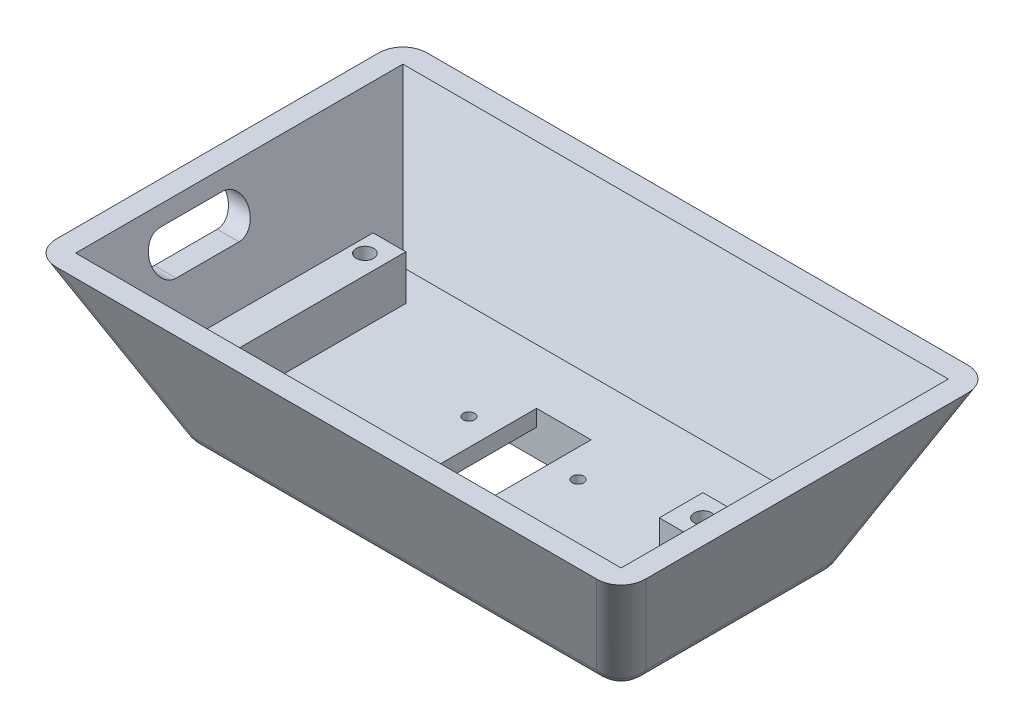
ISO-10303-21;
HEADER;
FILE_DESCRIPTION(('STEP AP214'),'2;1');
FILE_NAME('part.step','',(''),(''),'','','');
FILE_SCHEMA(('AUTOMOTIVE_DESIGN { 1 0 10303 214 1 1 1 1 }'));
ENDSEC;
DATA;
#1=APPLICATION_CONTEXT('core data for automotive mechanical design processes');
#2=APPLICATION_PROTOCOL_DEFINITION('international standard','automotive_design',2000,#1);
#3=PRODUCT_CONTEXT('',#1,'mechanical');
#4=PRODUCT('Part','Part','',(#3));
#5=PRODUCT_RELATED_PRODUCT_CATEGORY('part','',(#4));
#6=PRODUCT_DEFINITION_FORMATION('','',#4);
#7=PRODUCT_DEFINITION_CONTEXT('part definition',#1,'design');
#8=PRODUCT_DEFINITION('design','',#6,#7);
#9=PRODUCT_DEFINITION_SHAPE('','',#8);
#10=(LENGTH_UNIT() NAMED_UNIT(*) SI_UNIT(.MILLI.,.METRE.));
#11=(NAMED_UNIT(*) PLANE_ANGLE_UNIT() SI_UNIT($,.RADIAN.));
#12=(NAMED_UNIT(*) SI_UNIT($,.STERADIAN.) SOLID_ANGLE_UNIT());
#13=UNCERTAINTY_MEASURE_WITH_UNIT(LENGTH_MEASURE(1.E-05),#10,'distance_accuracy_value','');
#14=(GEOMETRIC_REPRESENTATION_CONTEXT(3) GLOBAL_UNCERTAINTY_ASSIGNED_CONTEXT((#13)) GLOBAL_UNIT_ASSIGNED_CONTEXT((#10,
#11,#12)) REPRESENTATION_CONTEXT('',''));
#15=CARTESIAN_POINT('',(0.,0.,0.));
#16=DIRECTION('',(0.,0.,1.));
#17=DIRECTION('',(1.,0.,0.));
#18=AXIS2_PLACEMENT_3D('',#15,#16,#17);
#19=CARTESIAN_POINT('',(0.,8.,0.));
#20=DIRECTION('',(0.,1.,0.));
#21=DIRECTION('',(0.,0.,1.));
#22=AXIS2_PLACEMENT_3D('',#19,#20,#21);
#23=PLANE('',#22);
#24=CARTESIAN_POINT('',(-10.,8.,-2.1));
#25=DIRECTION('',(0.,1.,0.));
#26=DIRECTION('',(0.,0.,1.));
#27=AXIS2_PLACEMENT_3D('',#24,#25,#26);
#28=CIRCLE('',#27,1.05);
#29=CARTESIAN_POINT('',(-10.,8.,-1.05));
#30=VERTEX_POINT('',#29);
#31=EDGE_CURVE('E424',#30,#30,#28,.F.);
#32=ORIENTED_EDGE('',*,*,#31,.T.);
#33=EDGE_LOOP('',(#32));
#34=FACE_BOUND('',#33,.T.);
#35=DIRECTION('',(0.,0.,-1.));
#36=VECTOR('',#35,1.);
#37=CARTESIAN_POINT('',(-5.1,8.,9.6));
#38=LINE('',#37,#36);
#39=CARTESIAN_POINT('',(-5.1,8.,9.6));
#40=VERTEX_POINT('',#39);
#41=CARTESIAN_POINT('',(-5.1,8.,-9.6));
#42=VERTEX_POINT('',#41);
#43=EDGE_CURVE('E454',#40,#42,#38,.T.);
#44=ORIENTED_EDGE('',*,*,#43,.T.);
#45=DIRECTION('',(1.,0.,0.));
#46=VECTOR('',#45,1.);
#47=CARTESIAN_POINT('',(4.9,8.,-9.6));
#48=LINE('',#47,#46);
#49=CARTESIAN_POINT('',(4.9,8.,-9.6));
#50=VERTEX_POINT('',#49);
#51=EDGE_CURVE('E429',#42,#50,#48,.T.);
#52=ORIENTED_EDGE('',*,*,#51,.T.);
#53=DIRECTION('',(0.,0.,1.));
#54=VECTOR('',#53,1.);
#55=CARTESIAN_POINT('',(4.9,8.,9.6));
#56=LINE('',#55,#54);
#57=CARTESIAN_POINT('',(4.9,8.,9.6));
#58=VERTEX_POINT('',#57);
#59=EDGE_CURVE('E428',#50,#58,#56,.T.);
#60=ORIENTED_EDGE('',*,*,#59,.T.);
#61=DIRECTION('',(-1.,0.,0.));
#62=VECTOR('',#61,1.);
#63=CARTESIAN_POINT('',(4.9,8.,9.6));
#64=LINE('',#63,#62);
#65=EDGE_CURVE('E458',#58,#40,#64,.T.);
#66=ORIENTED_EDGE('',*,*,#65,.T.);
#67=EDGE_LOOP('',(#44,#52,#60,#66));
#68=FACE_BOUND('',#67,.T.);
#69=CARTESIAN_POINT('',(10.,8.,-2.1));
#70=DIRECTION('',(0.,1.,0.));
#71=DIRECTION('',(0.,0.,1.));
#72=AXIS2_PLACEMENT_3D('',#69,#70,#71);
#73=CIRCLE('',#72,1.05);
#74=CARTESIAN_POINT('',(10.,8.,-1.05));
#75=VERTEX_POINT('',#74);
#76=EDGE_CURVE('E434',#75,#75,#73,.F.);
#77=ORIENTED_EDGE('',*,*,#76,.T.);
#78=EDGE_LOOP('',(#77));
#79=FACE_BOUND('',#78,.T.);
#80=DIRECTION('',(1.,0.,0.));
#81=VECTOR('',#80,1.);
#82=CARTESIAN_POINT('',(0.,8.,-3.26953873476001));
#83=LINE('',#82,#81);
#84=CARTESIAN_POINT('',(31.73046126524,8.,-3.26953873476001));
#85=VERTEX_POINT('',#84);
#86=CARTESIAN_POINT('',(39.73046126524,8.,-3.26953873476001));
#87=VERTEX_POINT('',#86);
#88=EDGE_CURVE('E340',#85,#87,#83,.T.);
#89=ORIENTED_EDGE('',*,*,#88,.T.);
#90=DIRECTION('',(0.,0.,-1.));
#91=VECTOR('',#90,1.);
#92=CARTESIAN_POINT('',(39.73046126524,8.,0.));
#93=LINE('',#92,#91);
#94=CARTESIAN_POINT('',(39.73046126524,8.,-19.73046126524));
#95=VERTEX_POINT('',#94);
#96=EDGE_CURVE('E508',#87,#95,#93,.T.);
#97=ORIENTED_EDGE('',*,*,#96,.T.);
#98=DIRECTION('',(-1.,0.,0.));
#99=VECTOR('',#98,1.);
#100=CARTESIAN_POINT('',(0.,8.,-19.73046126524));
#101=LINE('',#100,#99);
#102=CARTESIAN_POINT('',(-39.73046126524,8.,-19.73046126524));
#103=VERTEX_POINT('',#102);
#104=EDGE_CURVE('E485',#95,#103,#101,.T.);
#105=ORIENTED_EDGE('',*,*,#104,.T.);
#106=DIRECTION('',(0.,0.,1.));
#107=VECTOR('',#106,1.);
#108=CARTESIAN_POINT('',(-39.73046126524,8.,0.));
#109=LINE('',#108,#107);
#110=CARTESIAN_POINT('',(-39.73046126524,8.,-14.26953873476));
#111=VERTEX_POINT('',#110);
#112=EDGE_CURVE('E504',#103,#111,#109,.T.);
#113=ORIENTED_EDGE('',*,*,#112,.T.);
#114=DIRECTION('',(1.,0.,0.));
#115=VECTOR('',#114,1.);
#116=CARTESIAN_POINT('',(0.,8.,-14.26953873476));
#117=LINE('',#116,#115);
#118=CARTESIAN_POINT('',(-33.73046126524,8.,-14.26953873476));
#119=VERTEX_POINT('',#118);
#120=EDGE_CURVE('E382',#111,#119,#117,.T.);
#121=ORIENTED_EDGE('',*,*,#120,.T.);
#122=DIRECTION('',(0.,0.,1.));
#123=VECTOR('',#122,1.);
#124=CARTESIAN_POINT('',(-33.73046126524,8.,0.));
#125=LINE('',#124,#123);
#126=CARTESIAN_POINT('',(-33.73046126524,8.,19.73046126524));
#127=VERTEX_POINT('',#126);
#128=EDGE_CURVE('E376',#119,#127,#125,.T.);
#129=ORIENTED_EDGE('',*,*,#128,.T.);
#130=DIRECTION('',(1.,0.,0.));
#131=VECTOR('',#130,1.);
#132=CARTESIAN_POINT('',(0.,8.,19.73046126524));
#133=LINE('',#132,#131);
#134=CARTESIAN_POINT('',(39.73046126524,8.,19.73046126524));
#135=VERTEX_POINT('',#134);
#136=EDGE_CURVE('E513',#127,#135,#133,.T.);
#137=ORIENTED_EDGE('',*,*,#136,.T.);
#138=CARTESIAN_POINT('',(39.73046126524,8.,4.73046126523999));
#139=VERTEX_POINT('',#138);
#140=EDGE_CURVE('E496',#135,#139,#93,.T.);
#141=ORIENTED_EDGE('',*,*,#140,.T.);
#142=DIRECTION('',(-1.,0.,0.));
#143=VECTOR('',#142,1.);
#144=CARTESIAN_POINT('',(0.,8.,4.73046126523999));
#145=LINE('',#144,#143);
#146=CARTESIAN_POINT('',(31.73046126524,8.,4.73046126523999));
#147=VERTEX_POINT('',#146);
#148=EDGE_CURVE('E348',#139,#147,#145,.T.);
#149=ORIENTED_EDGE('',*,*,#148,.T.);
#150=DIRECTION('',(0.,0.,-1.));
#151=VECTOR('',#150,1.);
#152=CARTESIAN_POINT('',(31.73046126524,8.,0.));
#153=LINE('',#152,#151);
#154=EDGE_CURVE('E344',#147,#85,#153,.T.);
#155=ORIENTED_EDGE('',*,*,#154,.T.);
#156=EDGE_LOOP('',(#89,#97,#105,#113,#121,#129,#137,#141,#149,#155));
#157=FACE_BOUND('',#156,.T.);
#158=ADVANCED_FACE('F45',(#34,#68,#79,#157),#23,.T.);
#159=CARTESIAN_POINT('',(0.,5.,0.));
#160=DIRECTION('',(0.,-1.,0.));
#161=DIRECTION('',(0.,0.,-1.));
#162=AXIS2_PLACEMENT_3D('',#159,#160,#161);
#163=PLANE('',#162);
#164=DIRECTION('',(0.,0.,-1.));
#165=VECTOR('',#164,1.);
#166=CARTESIAN_POINT('',(-5.1,5.,9.6));
#167=LINE('',#166,#165);
#168=CARTESIAN_POINT('',(-5.1,5.,9.6));
#169=VERTEX_POINT('',#168);
#170=CARTESIAN_POINT('',(-5.1,5.,-9.6));
#171=VERTEX_POINT('',#170);
#172=EDGE_CURVE('E450',#169,#171,#167,.T.);
#173=ORIENTED_EDGE('',*,*,#172,.F.);
#174=DIRECTION('',(-1.,0.,0.));
#175=VECTOR('',#174,1.);
#176=CARTESIAN_POINT('',(-15.1,5.,9.6));
#177=LINE('',#176,#175);
#178=CARTESIAN_POINT('',(-15.1,5.,9.6));
#179=VERTEX_POINT('',#178);
#180=EDGE_CURVE('E521',#169,#179,#177,.T.);
#181=ORIENTED_EDGE('',*,*,#180,.T.);
#182=DIRECTION('',(0.,0.,-1.));
#183=VECTOR('',#182,1.);
#184=CARTESIAN_POINT('',(-15.1,5.,9.6));
#185=LINE('',#184,#183);
#186=CARTESIAN_POINT('',(-15.1,5.,-9.6));
#187=VERTEX_POINT('',#186);
#188=EDGE_CURVE('E527',#179,#187,#185,.T.);
#189=ORIENTED_EDGE('',*,*,#188,.T.);
#190=DIRECTION('',(1.,0.,0.));
#191=VECTOR('',#190,1.);
#192=CARTESIAN_POINT('',(-15.1,5.,-9.6));
#193=LINE('',#192,#191);
#194=EDGE_CURVE('E532',#187,#171,#193,.T.);
#195=ORIENTED_EDGE('',*,*,#194,.T.);
#196=EDGE_LOOP('',(#173,#181,#189,#195));
#197=FACE_BOUND('',#196,.T.);
#198=CARTESIAN_POINT('',(-10.,5.,-2.1));
#199=DIRECTION('',(0.,-1.,0.));
#200=DIRECTION('',(0.,0.,-1.));
#201=AXIS2_PLACEMENT_3D('',#198,#199,#200);
#202=CIRCLE('',#201,1.05);
#203=CARTESIAN_POINT('',(-10.,5.,-3.15));
#204=VERTEX_POINT('',#203);
#205=EDGE_CURVE('E419',#204,#204,#202,.T.);
#206=ORIENTED_EDGE('',*,*,#205,.F.);
#207=EDGE_LOOP('',(#206));
#208=FACE_BOUND('',#207,.T.);
#209=ADVANCED_FACE('F759',(#197,#208),#163,.T.);
#210=CARTESIAN_POINT('',(40.,0.,-20.));
#211=DIRECTION('',(0.90630778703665,-0.4226182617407,0.));
#212=DIRECTION('',(0.4226182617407,0.90630778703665,0.));
#213=AXIS2_PLACEMENT_3D('',#210,#211,#212);
#214=PLANE('',#213);
#215=DIRECTION('',(0.,0.,1.));
#216=VECTOR('',#215,1.);
#217=CARTESIAN_POINT('',(53.98922974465,30.,-20.));
#218=LINE('',#217,#216);
#219=CARTESIAN_POINT('',(53.98922974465,30.,29.4576908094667));
#220=VERTEX_POINT('',#219);
#221=CARTESIAN_POINT('',(53.98922974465,30.,-29.4576908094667));
#222=VERTEX_POINT('',#221);
#223=EDGE_CURVE('E553',#220,#222,#218,.F.);
#224=ORIENTED_EDGE('',*,*,#223,.F.);
#225=DIRECTION('',(0.389281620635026,0.834817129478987,0.389281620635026));
#226=VECTOR('',#225,1.);
#227=CARTESIAN_POINT('',(34.6251030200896,-11.5265037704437,10.0935640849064));
#228=LINE('',#227,#226);
#229=CARTESIAN_POINT('',(41.3461876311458,2.8869086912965,16.8146486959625));
#230=VERTEX_POINT('',#229);
#231=EDGE_CURVE('E624',#220,#230,#228,.F.);
#232=ORIENTED_EDGE('',*,*,#231,.T.);
#233=DIRECTION('',(0.,0.,-1.));
#234=VECTOR('',#233,1.);
#235=CARTESIAN_POINT('',(41.3461876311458,2.8869086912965,-20.));
#236=LINE('',#235,#234);
#237=CARTESIAN_POINT('',(41.3461876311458,2.8869086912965,-16.8146486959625));
#238=VERTEX_POINT('',#237);
#239=EDGE_CURVE('E621',#230,#238,#236,.T.);
#240=ORIENTED_EDGE('',*,*,#239,.T.);
#241=DIRECTION('',(0.389281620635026,0.834817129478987,-0.389281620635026));
#242=VECTOR('',#241,1.);
#243=CARTESIAN_POINT('',(40.6867102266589,1.4726548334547,-16.1551712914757));
#244=LINE('',#243,#242);
#245=EDGE_CURVE('E618',#238,#222,#244,.T.);
#246=ORIENTED_EDGE('',*,*,#245,.T.);
#247=EDGE_LOOP('',(#224,#232,#240,#246));
#248=FACE_BOUND('',#247,.T.);
#249=ADVANCED_FACE('F722',(#248),#214,.T.);
#250=CARTESIAN_POINT('',(-40.,0.,-20.));
#251=DIRECTION('',(0.,-0.4226182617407,-0.90630778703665));
#252=DIRECTION('',(0.,0.90630778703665,-0.4226182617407));
#253=AXIS2_PLACEMENT_3D('',#250,#251,#252);
#254=PLANE('',#253);
#255=DIRECTION('',(1.,0.,0.));
#256=VECTOR('',#255,1.);
#257=CARTESIAN_POINT('',(-40.,30.,-33.98922974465));
#258=LINE('',#257,#256);
#259=CARTESIAN_POINT('',(49.4576908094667,30.,-33.98922974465));
#260=VERTEX_POINT('',#259);
#261=CARTESIAN_POINT('',(-49.4576908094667,30.,-33.98922974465));
#262=VERTEX_POINT('',#261);
#263=EDGE_CURVE('E566',#260,#262,#258,.F.);
#264=ORIENTED_EDGE('',*,*,#263,.F.);
#265=DIRECTION('',(0.389281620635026,0.834817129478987,-0.389281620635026));
#266=VECTOR('',#265,1.);
#267=CARTESIAN_POINT('',(24.0319568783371,-24.5256623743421,-8.56349581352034));
#268=LINE('',#267,#266);
#269=CARTESIAN_POINT('',(36.8146486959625,2.8869086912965,-21.3461876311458));
#270=VERTEX_POINT('',#269);
#271=EDGE_CURVE('E63',#260,#270,#268,.F.);
#272=ORIENTED_EDGE('',*,*,#271,.T.);
#273=DIRECTION('',(-1.,0.,0.));
#274=VECTOR('',#273,1.);
#275=CARTESIAN_POINT('',(-40.,2.8869086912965,-21.3461876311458));
#276=LINE('',#275,#274);
#277=CARTESIAN_POINT('',(-36.8146486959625,2.8869086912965,-21.3461876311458));
#278=VERTEX_POINT('',#277);
#279=EDGE_CURVE('E68',#270,#278,#276,.T.);
#280=ORIENTED_EDGE('',*,*,#279,.T.);
#281=DIRECTION('',(-0.389281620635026,0.834817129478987,-0.389281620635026));
#282=VECTOR('',#281,1.);
#283=CARTESIAN_POINT('',(-36.1551712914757,1.4726548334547,-20.6867102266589));
#284=LINE('',#283,#282);
#285=EDGE_CURVE('E627',#278,#262,#284,.T.);
#286=ORIENTED_EDGE('',*,*,#285,.T.);
#287=EDGE_LOOP('',(#264,#272,#280,#286));
#288=FACE_BOUND('',#287,.T.);
#289=ADVANCED_FACE('F716',(#288),#254,.T.);
#290=CARTESIAN_POINT('',(-40.,0.,-20.));
#291=DIRECTION('',(-0.90630778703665,-0.4226182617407,0.));
#292=DIRECTION('',(0.4226182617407,-0.90630778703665,0.));
#293=AXIS2_PLACEMENT_3D('',#290,#291,#292);
#294=PLANE('',#293);
#295=DIRECTION('',(0.,0.,1.));
#296=VECTOR('',#295,1.);
#297=CARTESIAN_POINT('',(-52.8234605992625,27.5,15.75));
#298=LINE('',#297,#296);
#299=CARTESIAN_POINT('',(-52.8234605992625,27.5,15.75));
#300=VERTEX_POINT('',#299);
#301=CARTESIAN_POINT('',(-52.8234605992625,27.5,4.25000000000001));
#302=VERTEX_POINT('',#301);
#303=EDGE_CURVE('E307',#300,#302,#298,.F.);
#304=ORIENTED_EDGE('',*,*,#303,.F.);
#305=CARTESIAN_POINT('',(-51.3079607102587,24.25,15.75));
#306=DIRECTION('',(-0.90630778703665,-0.4226182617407,0.));
#307=DIRECTION('',(0.4226182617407,-0.90630778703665,0.));
#308=AXIS2_PLACEMENT_3D('',#305,#306,#307);
#309=ELLIPSE('',#308,3.5859782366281,3.25);
#310=CARTESIAN_POINT('',(-49.792460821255,21.,15.75));
#311=VERTEX_POINT('',#310);
#312=EDGE_CURVE('E311',#311,#300,#309,.T.);
#313=ORIENTED_EDGE('',*,*,#312,.F.);
#314=DIRECTION('',(0.,0.,-1.));
#315=VECTOR('',#314,1.);
#316=CARTESIAN_POINT('',(-49.792460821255,21.,15.75));
#317=LINE('',#316,#315);
#318=CARTESIAN_POINT('',(-49.792460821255,21.,4.25000000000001));
#319=VERTEX_POINT('',#318);
#320=EDGE_CURVE('E287',#319,#311,#317,.F.);
#321=ORIENTED_EDGE('',*,*,#320,.F.);
#322=CARTESIAN_POINT('',(-51.3079607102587,24.25,4.25000000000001));
#323=DIRECTION('',(-0.90630778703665,-0.4226182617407,0.));
#324=DIRECTION('',(0.4226182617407,-0.90630778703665,0.));
#325=AXIS2_PLACEMENT_3D('',#322,#323,#324);
#326=ELLIPSE('',#325,3.5859782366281,3.25);
#327=EDGE_CURVE('E272',#302,#319,#326,.T.);
#328=ORIENTED_EDGE('',*,*,#327,.F.);
#329=EDGE_LOOP('',(#304,#313,#321,#328));
#330=FACE_BOUND('',#329,.T.);
#331=DIRECTION('',(0.,0.,1.));
#332=VECTOR('',#331,1.);
#333=CARTESIAN_POINT('',(-41.3461876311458,2.8869086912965,-20.));
#334=LINE('',#333,#332);
#335=CARTESIAN_POINT('',(-41.3461876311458,2.8869086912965,-16.8146486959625));
#336=VERTEX_POINT('',#335);
#337=CARTESIAN_POINT('',(-41.3461876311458,2.8869086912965,16.8146486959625));
#338=VERTEX_POINT('',#337);
#339=EDGE_CURVE('E589',#336,#338,#334,.T.);
#340=ORIENTED_EDGE('',*,*,#339,.T.);
#341=DIRECTION('',(-0.389281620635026,0.834817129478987,0.389281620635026));
#342=VECTOR('',#341,1.);
#343=CARTESIAN_POINT('',(-34.6251030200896,-11.5265037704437,10.0935640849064));
#344=LINE('',#343,#342);
#345=CARTESIAN_POINT('',(-53.98922974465,30.,29.4576908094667));
#346=VERTEX_POINT('',#345);
#347=EDGE_CURVE('E593',#338,#346,#344,.T.);
#348=ORIENTED_EDGE('',*,*,#347,.T.);
#349=DIRECTION('',(0.,0.,-1.));
#350=VECTOR('',#349,1.);
#351=CARTESIAN_POINT('',(-53.98922974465,30.,-20.));
#352=LINE('',#351,#350);
#353=CARTESIAN_POINT('',(-53.98922974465,30.,-29.4576908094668));
#354=VERTEX_POINT('',#353);
#355=EDGE_CURVE('E570',#354,#346,#352,.F.);
#356=ORIENTED_EDGE('',*,*,#355,.F.);
#357=DIRECTION('',(-0.389281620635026,0.834817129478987,-0.389281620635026));
#358=VECTOR('',#357,1.);
#359=CARTESIAN_POINT('',(-40.6867102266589,1.4726548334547,-16.1551712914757));
#360=LINE('',#359,#358);
#361=EDGE_CURVE('E586',#354,#336,#360,.F.);
#362=ORIENTED_EDGE('',*,*,#361,.T.);
#363=EDGE_LOOP('',(#340,#348,#356,#362));
#364=FACE_BOUND('',#363,.T.);
#365=ADVANCED_FACE('F743',(#330,#364),#294,.T.);
#366=CARTESIAN_POINT('',(-40.,0.,20.));
#367=DIRECTION('',(0.,-0.4226182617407,0.90630778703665));
#368=DIRECTION('',(0.,-0.90630778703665,-0.4226182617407));
#369=AXIS2_PLACEMENT_3D('',#366,#367,#368);
#370=PLANE('',#369);
#371=DIRECTION('',(-1.,0.,0.));
#372=VECTOR('',#371,1.);
#373=CARTESIAN_POINT('',(-40.,30.,33.98922974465));
#374=LINE('',#373,#372);
#375=CARTESIAN_POINT('',(-49.4576908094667,30.,33.98922974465));
#376=VERTEX_POINT('',#375);
#377=CARTESIAN_POINT('',(49.4576908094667,30.,33.98922974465));
#378=VERTEX_POINT('',#377);
#379=EDGE_CURVE('E574',#376,#378,#374,.F.);
#380=ORIENTED_EDGE('',*,*,#379,.F.);
#381=DIRECTION('',(-0.389281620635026,0.834817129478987,0.389281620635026));
#382=VECTOR('',#381,1.);
#383=CARTESIAN_POINT('',(-36.1551712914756,1.4726548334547,20.6867102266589));
#384=LINE('',#383,#382);
#385=CARTESIAN_POINT('',(-36.8146486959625,2.8869086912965,21.3461876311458));
#386=VERTEX_POINT('',#385);
#387=EDGE_CURVE('E615',#376,#386,#384,.F.);
#388=ORIENTED_EDGE('',*,*,#387,.T.);
#389=DIRECTION('',(1.,0.,0.));
#390=VECTOR('',#389,1.);
#391=CARTESIAN_POINT('',(-40.,2.8869086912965,21.3461876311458));
#392=LINE('',#391,#390);
#393=CARTESIAN_POINT('',(36.8146486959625,2.8869086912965,21.3461876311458));
#394=VERTEX_POINT('',#393);
#395=EDGE_CURVE('E612',#386,#394,#392,.T.);
#396=ORIENTED_EDGE('',*,*,#395,.T.);
#397=DIRECTION('',(0.389281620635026,0.834817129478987,0.389281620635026));
#398=VECTOR('',#397,1.);
#399=CARTESIAN_POINT('',(24.0319568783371,-24.5256623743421,8.56349581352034));
#400=LINE('',#399,#398);
#401=EDGE_CURVE('E609',#394,#378,#400,.T.);
#402=ORIENTED_EDGE('',*,*,#401,.T.);
#403=EDGE_LOOP('',(#380,#388,#396,#402));
#404=FACE_BOUND('',#403,.T.);
#405=ADVANCED_FACE('F746',(#404),#370,.T.);
#406=CARTESIAN_POINT('',(0.,30.,0.));
#407=DIRECTION('',(0.,1.,0.));
#408=DIRECTION('',(0.,0.,1.));
#409=AXIS2_PLACEMENT_3D('',#406,#407,#408);
#410=PLANE('',#409);
#411=DIRECTION('',(-1.,0.,0.));
#412=VECTOR('',#411,1.);
#413=CARTESIAN_POINT('',(49.98922974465,30.,-29.98922974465));
#414=LINE('',#413,#412);
#415=CARTESIAN_POINT('',(49.98922974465,30.,-29.98922974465));
#416=VERTEX_POINT('',#415);
#417=CARTESIAN_POINT('',(-49.98922974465,30.,-29.98922974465));
#418=VERTEX_POINT('',#417);
#419=EDGE_CURVE('E423',#416,#418,#414,.T.);
#420=ORIENTED_EDGE('',*,*,#419,.F.);
#421=DIRECTION('',(0.,0.,-1.));
#422=VECTOR('',#421,1.);
#423=CARTESIAN_POINT('',(49.98922974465,30.,29.98922974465));
#424=LINE('',#423,#422);
#425=CARTESIAN_POINT('',(49.98922974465,30.,29.98922974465));
#426=VERTEX_POINT('',#425);
#427=EDGE_CURVE('E481',#426,#416,#424,.T.);
#428=ORIENTED_EDGE('',*,*,#427,.F.);
#429=DIRECTION('',(1.,0.,0.));
#430=VECTOR('',#429,1.);
#431=CARTESIAN_POINT('',(-49.98922974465,30.,29.98922974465));
#432=LINE('',#431,#430);
#433=CARTESIAN_POINT('',(-49.98922974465,30.,29.98922974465));
#434=VERTEX_POINT('',#433);
#435=EDGE_CURVE('E477',#434,#426,#432,.T.);
#436=ORIENTED_EDGE('',*,*,#435,.F.);
#437=DIRECTION('',(0.,0.,1.));
#438=VECTOR('',#437,1.);
#439=CARTESIAN_POINT('',(-49.98922974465,30.,-29.98922974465));
#440=LINE('',#439,#438);
#441=EDGE_CURVE('E473',#418,#434,#440,.T.);
#442=ORIENTED_EDGE('',*,*,#441,.F.);
#443=EDGE_LOOP('',(#420,#428,#436,#442));
#444=FACE_BOUND('',#443,.T.);
#445=ORIENTED_EDGE('',*,*,#355,.T.);
#446=CARTESIAN_POINT('',(-48.4723401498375,30.,28.4723401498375));
#447=DIRECTION('',(0.,1.,0.));
#448=DIRECTION('',(0.707106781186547,0.,-0.707106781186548));
#449=AXIS2_PLACEMENT_3D('',#446,#447,#448);
#450=ELLIPSE('',#449,5.98933565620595,5.);
#451=EDGE_CURVE('E11',#346,#376,#450,.T.);
#452=ORIENTED_EDGE('',*,*,#451,.T.);
#453=ORIENTED_EDGE('',*,*,#379,.T.);
#454=CARTESIAN_POINT('',(48.4723401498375,30.,28.4723401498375));
#455=DIRECTION('',(0.,1.,0.));
#456=DIRECTION('',(-0.707106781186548,0.,-0.707106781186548));
#457=AXIS2_PLACEMENT_3D('',#454,#455,#456);
#458=ELLIPSE('',#457,5.98933565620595,5.);
#459=EDGE_CURVE('E55',#378,#220,#458,.T.);
#460=ORIENTED_EDGE('',*,*,#459,.T.);
#461=ORIENTED_EDGE('',*,*,#223,.T.);
#462=CARTESIAN_POINT('',(48.4723401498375,30.,-28.4723401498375));
#463=DIRECTION('',(0.,1.,0.));
#464=DIRECTION('',(-0.707106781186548,0.,0.707106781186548));
#465=AXIS2_PLACEMENT_3D('',#462,#463,#464);
#466=ELLIPSE('',#465,5.98933565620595,5.);
#467=EDGE_CURVE('E637',#222,#260,#466,.T.);
#468=ORIENTED_EDGE('',*,*,#467,.T.);
#469=ORIENTED_EDGE('',*,*,#263,.T.);
#470=CARTESIAN_POINT('',(-48.4723401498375,30.,-28.4723401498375));
#471=DIRECTION('',(0.,1.,0.));
#472=DIRECTION('',(0.707106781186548,0.,0.707106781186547));
#473=AXIS2_PLACEMENT_3D('',#470,#471,#472);
#474=ELLIPSE('',#473,5.98933565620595,5.);
#475=EDGE_CURVE('E634',#262,#354,#474,.T.);
#476=ORIENTED_EDGE('',*,*,#475,.T.);
#477=EDGE_LOOP('',(#445,#452,#453,#460,#461,#468,#469,#476));
#478=FACE_BOUND('',#477,.T.);
#479=ADVANCED_FACE('F718',(#444,#478),#410,.T.);
#480=CARTESIAN_POINT('',(0.,0.,0.));
#481=DIRECTION('',(0.,1.,0.));
#482=DIRECTION('',(0.,0.,1.));
#483=AXIS2_PLACEMENT_3D('',#480,#481,#482);
#484=PLANE('',#483);
#485=DIRECTION('',(-1.,0.,0.));
#486=VECTOR('',#485,1.);
#487=CARTESIAN_POINT('',(0.,0.,16.8146486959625));
#488=LINE('',#487,#486);
#489=CARTESIAN_POINT('',(36.8146486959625,0.,16.8146486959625));
#490=VERTEX_POINT('',#489);
#491=CARTESIAN_POINT('',(-36.8146486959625,0.,16.8146486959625));
#492=VERTEX_POINT('',#491);
#493=EDGE_CURVE('E602',#490,#492,#488,.T.);
#494=ORIENTED_EDGE('',*,*,#493,.T.);
#495=DIRECTION('',(0.,0.,-1.));
#496=VECTOR('',#495,1.);
#497=CARTESIAN_POINT('',(-36.8146486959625,0.,0.));
#498=LINE('',#497,#496);
#499=CARTESIAN_POINT('',(-36.8146486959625,0.,-16.8146486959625));
#500=VERTEX_POINT('',#499);
#501=EDGE_CURVE('E605',#492,#500,#498,.T.);
#502=ORIENTED_EDGE('',*,*,#501,.T.);
#503=DIRECTION('',(1.,0.,0.));
#504=VECTOR('',#503,1.);
#505=CARTESIAN_POINT('',(0.,0.,-16.8146486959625));
#506=LINE('',#505,#504);
#507=CARTESIAN_POINT('',(36.8146486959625,0.,-16.8146486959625));
#508=VERTEX_POINT('',#507);
#509=EDGE_CURVE('E596',#500,#508,#506,.T.);
#510=ORIENTED_EDGE('',*,*,#509,.T.);
#511=DIRECTION('',(0.,0.,1.));
#512=VECTOR('',#511,1.);
#513=CARTESIAN_POINT('',(36.8146486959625,0.,0.));
#514=LINE('',#513,#512);
#515=EDGE_CURVE('E599',#508,#490,#514,.T.);
#516=ORIENTED_EDGE('',*,*,#515,.T.);
#517=EDGE_LOOP('',(#494,#502,#510,#516));
#518=FACE_BOUND('',#517,.T.);
#519=DIRECTION('',(-1.,0.,0.));
#520=VECTOR('',#519,1.);
#521=CARTESIAN_POINT('',(-15.1,0.,9.6));
#522=LINE('',#521,#520);
#523=CARTESIAN_POINT('',(15.1,0.,9.6));
#524=VERTEX_POINT('',#523);
#525=CARTESIAN_POINT('',(-15.1,0.,9.6));
#526=VERTEX_POINT('',#525);
#527=EDGE_CURVE('E539',#524,#526,#522,.T.);
#528=ORIENTED_EDGE('',*,*,#527,.F.);
#529=DIRECTION('',(0.,0.,1.));
#530=VECTOR('',#529,1.);
#531=CARTESIAN_POINT('',(15.1,0.,9.6));
#532=LINE('',#531,#530);
#533=CARTESIAN_POINT('',(15.1,0.,-9.6));
#534=VERTEX_POINT('',#533);
#535=EDGE_CURVE('E489',#534,#524,#532,.T.);
#536=ORIENTED_EDGE('',*,*,#535,.F.);
#537=DIRECTION('',(1.,0.,0.));
#538=VECTOR('',#537,1.);
#539=CARTESIAN_POINT('',(-15.1,0.,-9.6));
#540=LINE('',#539,#538);
#541=CARTESIAN_POINT('',(-15.1,0.,-9.6));
#542=VERTEX_POINT('',#541);
#543=EDGE_CURVE('E522',#542,#534,#540,.T.);
#544=ORIENTED_EDGE('',*,*,#543,.F.);
#545=DIRECTION('',(0.,0.,-1.));
#546=VECTOR('',#545,1.);
#547=CARTESIAN_POINT('',(-15.1,0.,9.6));
#548=LINE('',#547,#546);
#549=EDGE_CURVE('E543',#526,#542,#548,.T.);
#550=ORIENTED_EDGE('',*,*,#549,.F.);
#551=EDGE_LOOP('',(#528,#536,#544,#550));
#552=FACE_BOUND('',#551,.T.);
#553=ADVANCED_FACE('F698',(#518,#552),#484,.F.);
#554=CARTESIAN_POINT('',(15.1,5.,9.6));
#555=DIRECTION('',(1.,0.,0.));
#556=DIRECTION('',(0.,0.,-1.));
#557=AXIS2_PLACEMENT_3D('',#554,#555,#556);
#558=PLANE('',#557);
#559=ORIENTED_EDGE('',*,*,#535,.T.);
#560=DIRECTION('',(0.,-1.,0.));
#561=VECTOR('',#560,1.);
#562=CARTESIAN_POINT('',(15.1,5.,9.6));
#563=LINE('',#562,#561);
#564=CARTESIAN_POINT('',(15.1,5.,9.6));
#565=VERTEX_POINT('',#564);
#566=EDGE_CURVE('E536',#565,#524,#563,.T.);
#567=ORIENTED_EDGE('',*,*,#566,.F.);
#568=DIRECTION('',(0.,0.,1.));
#569=VECTOR('',#568,1.);
#570=CARTESIAN_POINT('',(15.1,5.,9.6));
#571=LINE('',#570,#569);
#572=CARTESIAN_POINT('',(15.1,5.,-9.6));
#573=VERTEX_POINT('',#572);
#574=EDGE_CURVE('E517',#573,#565,#571,.T.);
#575=ORIENTED_EDGE('',*,*,#574,.F.);
#576=DIRECTION('',(0.,-1.,0.));
#577=VECTOR('',#576,1.);
#578=CARTESIAN_POINT('',(15.1,5.,-9.6));
#579=LINE('',#578,#577);
#580=EDGE_CURVE('E550',#573,#534,#579,.T.);
#581=ORIENTED_EDGE('',*,*,#580,.T.);
#582=EDGE_LOOP('',(#559,#567,#575,#581));
#583=FACE_BOUND('',#582,.T.);
#584=ADVANCED_FACE('F859',(#583),#558,.F.);
#585=CARTESIAN_POINT('',(-15.1,5.,-9.6));
#586=DIRECTION('',(0.,0.,-1.));
#587=DIRECTION('',(-1.,0.,0.));
#588=AXIS2_PLACEMENT_3D('',#585,#586,#587);
#589=PLANE('',#588);
#590=ORIENTED_EDGE('',*,*,#543,.T.);
#591=ORIENTED_EDGE('',*,*,#580,.F.);
#592=CARTESIAN_POINT('',(4.9,5.,-9.6));
#593=VERTEX_POINT('',#592);
#594=EDGE_CURVE('E531',#593,#573,#193,.T.);
#595=ORIENTED_EDGE('',*,*,#594,.F.);
#596=DIRECTION('',(0.,-1.,0.));
#597=VECTOR('',#596,1.);
#598=CARTESIAN_POINT('',(4.9,30.001,-9.6));
#599=LINE('',#598,#597);
#600=EDGE_CURVE('E439',#50,#593,#599,.T.);
#601=ORIENTED_EDGE('',*,*,#600,.F.);
#602=ORIENTED_EDGE('',*,*,#51,.F.);
#603=DIRECTION('',(0.,-1.,0.));
#604=VECTOR('',#603,1.);
#605=CARTESIAN_POINT('',(-5.1,30.001,-9.6));
#606=LINE('',#605,#604);
#607=EDGE_CURVE('E435',#42,#171,#606,.T.);
#608=ORIENTED_EDGE('',*,*,#607,.T.);
#609=ORIENTED_EDGE('',*,*,#194,.F.);
#610=DIRECTION('',(0.,-1.,0.));
#611=VECTOR('',#610,1.);
#612=CARTESIAN_POINT('',(-15.1,5.,-9.6));
#613=LINE('',#612,#611);
#614=EDGE_CURVE('E554',#187,#542,#613,.T.);
#615=ORIENTED_EDGE('',*,*,#614,.T.);
#616=EDGE_LOOP('',(#590,#591,#595,#601,#602,#608,#609,#615));
#617=FACE_BOUND('',#616,.T.);
#618=ADVANCED_FACE('F856',(#617),#589,.F.);
#619=CARTESIAN_POINT('',(-15.1,5.,9.6));
#620=DIRECTION('',(-1.,0.,0.));
#621=DIRECTION('',(0.,0.,1.));
#622=AXIS2_PLACEMENT_3D('',#619,#620,#621);
#623=PLANE('',#622);
#624=ORIENTED_EDGE('',*,*,#549,.T.);
#625=ORIENTED_EDGE('',*,*,#614,.F.);
#626=ORIENTED_EDGE('',*,*,#188,.F.);
#627=DIRECTION('',(0.,-1.,0.));
#628=VECTOR('',#627,1.);
#629=CARTESIAN_POINT('',(-15.1,5.,9.6));
#630=LINE('',#629,#628);
#631=EDGE_CURVE('E557',#179,#526,#630,.T.);
#632=ORIENTED_EDGE('',*,*,#631,.T.);
#633=EDGE_LOOP('',(#624,#625,#626,#632));
#634=FACE_BOUND('',#633,.T.);
#635=ADVANCED_FACE('F849',(#634),#623,.F.);
#636=CARTESIAN_POINT('',(-15.1,5.,9.6));
#637=DIRECTION('',(0.,0.,1.));
#638=DIRECTION('',(1.,0.,0.));
#639=AXIS2_PLACEMENT_3D('',#636,#637,#638);
#640=PLANE('',#639);
#641=ORIENTED_EDGE('',*,*,#527,.T.);
#642=ORIENTED_EDGE('',*,*,#631,.F.);
#643=ORIENTED_EDGE('',*,*,#180,.F.);
#644=DIRECTION('',(0.,-1.,0.));
#645=VECTOR('',#644,1.);
#646=CARTESIAN_POINT('',(-5.1,30.001,9.6));
#647=LINE('',#646,#645);
#648=EDGE_CURVE('E433',#40,#169,#647,.T.);
#649=ORIENTED_EDGE('',*,*,#648,.F.);
#650=ORIENTED_EDGE('',*,*,#65,.F.);
#651=DIRECTION('',(0.,-1.,0.));
#652=VECTOR('',#651,1.);
#653=CARTESIAN_POINT('',(4.9,30.001,9.6));
#654=LINE('',#653,#652);
#655=CARTESIAN_POINT('',(4.9,5.,9.6));
#656=VERTEX_POINT('',#655);
#657=EDGE_CURVE('E442',#58,#656,#654,.T.);
#658=ORIENTED_EDGE('',*,*,#657,.T.);
#659=EDGE_CURVE('E523',#565,#656,#177,.T.);
#660=ORIENTED_EDGE('',*,*,#659,.F.);
#661=ORIENTED_EDGE('',*,*,#566,.T.);
#662=EDGE_LOOP('',(#641,#642,#643,#649,#650,#658,#660,#661));
#663=FACE_BOUND('',#662,.T.);
#664=ADVANCED_FACE('F841',(#663),#640,.F.);
#665=DIRECTION('',(0.,0.,1.));
#666=VECTOR('',#665,1.);
#667=CARTESIAN_POINT('',(4.9,5.,9.6));
#668=LINE('',#667,#666);
#669=EDGE_CURVE('E438',#593,#656,#668,.T.);
#670=ORIENTED_EDGE('',*,*,#669,.F.);
#671=ORIENTED_EDGE('',*,*,#594,.T.);
#672=ORIENTED_EDGE('',*,*,#574,.T.);
#673=ORIENTED_EDGE('',*,*,#659,.T.);
#674=EDGE_LOOP('',(#670,#671,#672,#673));
#675=FACE_BOUND('',#674,.T.);
#676=CARTESIAN_POINT('',(10.,5.,-2.1));
#677=DIRECTION('',(0.,-1.,0.));
#678=DIRECTION('',(0.,0.,1.));
#679=AXIS2_PLACEMENT_3D('',#676,#677,#678);
#680=CIRCLE('',#679,1.05);
#681=CARTESIAN_POINT('',(10.,5.,-1.05));
#682=VERTEX_POINT('',#681);
#683=EDGE_CURVE('E407',#682,#682,#680,.T.);
#684=ORIENTED_EDGE('',*,*,#683,.F.);
#685=EDGE_LOOP('',(#684));
#686=FACE_BOUND('',#685,.T.);
#687=ADVANCED_FACE('F769',(#675,#686),#163,.T.);
#688=CARTESIAN_POINT('',(49.98922974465,30.,-29.98922974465));
#689=DIRECTION('',(0.,-0.4226182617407,-0.90630778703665));
#690=DIRECTION('',(0.,0.90630778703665,-0.4226182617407));
#691=AXIS2_PLACEMENT_3D('',#688,#689,#690);
#692=PLANE('',#691);
#693=ORIENTED_EDGE('',*,*,#419,.T.);
#694=DIRECTION('',(-0.389281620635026,0.834817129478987,-0.389281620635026));
#695=VECTOR('',#694,1.);
#696=CARTESIAN_POINT('',(-34.8384759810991,-2.49089629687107,-14.8384759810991));
#697=LINE('',#696,#695);
#698=EDGE_CURVE('E491',#103,#418,#697,.T.);
#699=ORIENTED_EDGE('',*,*,#698,.F.);
#700=ORIENTED_EDGE('',*,*,#104,.F.);
#701=DIRECTION('',(0.389281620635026,0.834817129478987,-0.389281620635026));
#702=VECTOR('',#701,1.);
#703=CARTESIAN_POINT('',(40.9000831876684,10.5082623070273,-20.9000831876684));
#704=LINE('',#703,#702);
#705=EDGE_CURVE('E486',#95,#416,#704,.T.);
#706=ORIENTED_EDGE('',*,*,#705,.T.);
#707=EDGE_LOOP('',(#693,#699,#700,#706));
#708=FACE_BOUND('',#707,.T.);
#709=ADVANCED_FACE('F840',(#708),#692,.F.);
#710=CARTESIAN_POINT('',(49.98922974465,30.,29.98922974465));
#711=DIRECTION('',(0.90630778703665,-0.4226182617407,0.));
#712=DIRECTION('',(0.4226182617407,0.90630778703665,0.));
#713=AXIS2_PLACEMENT_3D('',#710,#711,#712);
#714=PLANE('',#713);
#715=ORIENTED_EDGE('',*,*,#427,.T.);
#716=ORIENTED_EDGE('',*,*,#705,.F.);
#717=ORIENTED_EDGE('',*,*,#96,.F.);
#718=DIRECTION('',(0.,0.,1.));
#719=VECTOR('',#718,1.);
#720=CARTESIAN_POINT('',(39.73046126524,8.,0.));
#721=LINE('',#720,#719);
#722=EDGE_CURVE('E351',#87,#139,#721,.T.);
#723=ORIENTED_EDGE('',*,*,#722,.T.);
#724=ORIENTED_EDGE('',*,*,#140,.F.);
#725=DIRECTION('',(0.389281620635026,0.834817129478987,0.389281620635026));
#726=VECTOR('',#725,1.);
#727=CARTESIAN_POINT('',(34.8384759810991,-2.49089629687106,14.8384759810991));
#728=LINE('',#727,#726);
#729=EDGE_CURVE('E490',#135,#426,#728,.T.);
#730=ORIENTED_EDGE('',*,*,#729,.T.);
#731=EDGE_LOOP('',(#715,#716,#717,#723,#724,#730));
#732=FACE_BOUND('',#731,.T.);
#733=ADVANCED_FACE('F847',(#732),#714,.F.);
#734=CARTESIAN_POINT('',(-49.98922974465,30.,29.98922974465));
#735=DIRECTION('',(0.,-0.4226182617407,0.90630778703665));
#736=DIRECTION('',(0.,-0.90630778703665,-0.4226182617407));
#737=AXIS2_PLACEMENT_3D('',#734,#735,#736);
#738=PLANE('',#737);
#739=ORIENTED_EDGE('',*,*,#435,.T.);
#740=ORIENTED_EDGE('',*,*,#729,.F.);
#741=ORIENTED_EDGE('',*,*,#136,.F.);
#742=CARTESIAN_POINT('',(-39.73046126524,8.,19.73046126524));
#743=VERTEX_POINT('',#742);
#744=EDGE_CURVE('E509',#743,#127,#133,.T.);
#745=ORIENTED_EDGE('',*,*,#744,.F.);
#746=DIRECTION('',(-0.389281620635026,0.834817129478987,0.389281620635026));
#747=VECTOR('',#746,1.);
#748=CARTESIAN_POINT('',(-40.9000831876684,10.5082623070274,20.9000831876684));
#749=LINE('',#748,#747);
#750=EDGE_CURVE('E495',#743,#434,#749,.T.);
#751=ORIENTED_EDGE('',*,*,#750,.T.);
#752=EDGE_LOOP('',(#739,#740,#741,#745,#751));
#753=FACE_BOUND('',#752,.T.);
#754=ADVANCED_FACE('F833',(#753),#738,.F.);
#755=CARTESIAN_POINT('',(-49.98922974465,30.,-29.98922974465));
#756=DIRECTION('',(-0.90630778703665,-0.4226182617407,0.));
#757=DIRECTION('',(0.4226182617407,-0.90630778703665,0.));
#758=AXIS2_PLACEMENT_3D('',#755,#756,#757);
#759=PLANE('',#758);
#760=DIRECTION('',(0.,0.,-1.));
#761=VECTOR('',#760,1.);
#762=CARTESIAN_POINT('',(-45.792460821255,21.,15.75));
#763=LINE('',#762,#761);
#764=CARTESIAN_POINT('',(-45.792460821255,21.,15.75));
#765=VERTEX_POINT('',#764);
#766=CARTESIAN_POINT('',(-45.792460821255,21.,4.25000000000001));
#767=VERTEX_POINT('',#766);
#768=EDGE_CURVE('E282',#765,#767,#763,.T.);
#769=ORIENTED_EDGE('',*,*,#768,.F.);
#770=CARTESIAN_POINT('',(-47.3079607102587,24.25,15.75));
#771=DIRECTION('',(-0.90630778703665,-0.4226182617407,0.));
#772=DIRECTION('',(0.4226182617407,-0.90630778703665,0.));
#773=AXIS2_PLACEMENT_3D('',#770,#771,#772);
#774=ELLIPSE('',#773,3.5859782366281,3.25);
#775=CARTESIAN_POINT('',(-48.8234605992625,27.5,15.75));
#776=VERTEX_POINT('',#775);
#777=EDGE_CURVE('E298',#776,#765,#774,.F.);
#778=ORIENTED_EDGE('',*,*,#777,.F.);
#779=DIRECTION('',(0.,0.,1.));
#780=VECTOR('',#779,1.);
#781=CARTESIAN_POINT('',(-48.8234605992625,27.5,15.75));
#782=LINE('',#781,#780);
#783=CARTESIAN_POINT('',(-48.8234605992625,27.5,4.25000000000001));
#784=VERTEX_POINT('',#783);
#785=EDGE_CURVE('E293',#784,#776,#782,.T.);
#786=ORIENTED_EDGE('',*,*,#785,.F.);
#787=CARTESIAN_POINT('',(-47.3079607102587,24.25,4.25000000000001));
#788=DIRECTION('',(-0.90630778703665,-0.4226182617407,0.));
#789=DIRECTION('',(0.4226182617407,-0.90630778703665,0.));
#790=AXIS2_PLACEMENT_3D('',#787,#788,#789);
#791=ELLIPSE('',#790,3.5859782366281,3.25);
#792=EDGE_CURVE('E269',#767,#784,#791,.F.);
#793=ORIENTED_EDGE('',*,*,#792,.F.);
#794=EDGE_LOOP('',(#769,#778,#786,#793));
#795=FACE_BOUND('',#794,.T.);
#796=ORIENTED_EDGE('',*,*,#441,.T.);
#797=ORIENTED_EDGE('',*,*,#750,.F.);
#798=DIRECTION('',(0.,0.,-1.));
#799=VECTOR('',#798,1.);
#800=CARTESIAN_POINT('',(-39.73046126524,8.,0.));
#801=LINE('',#800,#799);
#802=EDGE_CURVE('E398',#743,#111,#801,.T.);
#803=ORIENTED_EDGE('',*,*,#802,.T.);
#804=ORIENTED_EDGE('',*,*,#112,.F.);
#805=ORIENTED_EDGE('',*,*,#698,.T.);
#806=EDGE_LOOP('',(#796,#797,#803,#804,#805));
#807=FACE_BOUND('',#806,.T.);
#808=ADVANCED_FACE('F290',(#795,#807),#759,.F.);
#809=CARTESIAN_POINT('',(10.,30.001,-2.1));
#810=DIRECTION('',(0.,-1.,0.));
#811=DIRECTION('',(0.,0.,-1.));
#812=AXIS2_PLACEMENT_3D('',#809,#810,#811);
#813=CYLINDRICAL_SURFACE('',#812,1.05);
#814=ORIENTED_EDGE('',*,*,#76,.F.);
#815=EDGE_LOOP('',(#814));
#816=FACE_BOUND('',#815,.T.);
#817=ORIENTED_EDGE('',*,*,#683,.T.);
#818=EDGE_LOOP('',(#817));
#819=FACE_BOUND('',#818,.T.);
#820=ADVANCED_FACE('F824',(#816,#819),#813,.F.);
#821=CARTESIAN_POINT('',(-5.1,30.001,9.6));
#822=DIRECTION('',(-1.,0.,0.));
#823=DIRECTION('',(0.,0.,1.));
#824=AXIS2_PLACEMENT_3D('',#821,#822,#823);
#825=PLANE('',#824);
#826=ORIENTED_EDGE('',*,*,#648,.T.);
#827=ORIENTED_EDGE('',*,*,#172,.T.);
#828=ORIENTED_EDGE('',*,*,#607,.F.);
#829=ORIENTED_EDGE('',*,*,#43,.F.);
#830=EDGE_LOOP('',(#826,#827,#828,#829));
#831=FACE_BOUND('',#830,.T.);
#832=ADVANCED_FACE('F821',(#831),#825,.F.);
#833=CARTESIAN_POINT('',(4.9,30.001,9.6));
#834=DIRECTION('',(1.,0.,0.));
#835=DIRECTION('',(0.,0.,-1.));
#836=AXIS2_PLACEMENT_3D('',#833,#834,#835);
#837=PLANE('',#836);
#838=ORIENTED_EDGE('',*,*,#600,.T.);
#839=ORIENTED_EDGE('',*,*,#669,.T.);
#840=ORIENTED_EDGE('',*,*,#657,.F.);
#841=ORIENTED_EDGE('',*,*,#59,.F.);
#842=EDGE_LOOP('',(#838,#839,#840,#841));
#843=FACE_BOUND('',#842,.T.);
#844=ADVANCED_FACE('F819',(#843),#837,.F.);
#845=CARTESIAN_POINT('',(-10.,30.001,-2.1));
#846=DIRECTION('',(0.,-1.,0.));
#847=DIRECTION('',(0.,0.,-1.));
#848=AXIS2_PLACEMENT_3D('',#845,#846,#847);
#849=CYLINDRICAL_SURFACE('',#848,1.05);
#850=ORIENTED_EDGE('',*,*,#31,.F.);
#851=EDGE_LOOP('',(#850));
#852=FACE_BOUND('',#851,.T.);
#853=ORIENTED_EDGE('',*,*,#205,.T.);
#854=EDGE_LOOP('',(#853));
#855=FACE_BOUND('',#854,.T.);
#856=ADVANCED_FACE('F805',(#852,#855),#849,.F.);
#857=CARTESIAN_POINT('',(0.,16.2,0.));
#858=DIRECTION('',(0.,-1.,0.));
#859=DIRECTION('',(0.,0.,-1.));
#860=AXIS2_PLACEMENT_3D('',#857,#858,#859);
#861=PLANE('',#860);
#862=DIRECTION('',(0.,0.,1.));
#863=VECTOR('',#862,1.);
#864=CARTESIAN_POINT('',(-33.73046126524,16.2,0.));
#865=LINE('',#864,#863);
#866=CARTESIAN_POINT('',(-33.73046126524,16.2,-14.26953873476));
#867=VERTEX_POINT('',#866);
#868=CARTESIAN_POINT('',(-33.73046126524,16.2,19.73046126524));
#869=VERTEX_POINT('',#868);
#870=EDGE_CURVE('E377',#867,#869,#865,.T.);
#871=ORIENTED_EDGE('',*,*,#870,.F.);
#872=DIRECTION('',(1.,0.,0.));
#873=VECTOR('',#872,1.);
#874=CARTESIAN_POINT('',(0.,16.2,-14.26953873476));
#875=LINE('',#874,#873);
#876=CARTESIAN_POINT('',(-39.73046126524,16.2,-14.26953873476));
#877=VERTEX_POINT('',#876);
#878=EDGE_CURVE('E390',#877,#867,#875,.T.);
#879=ORIENTED_EDGE('',*,*,#878,.F.);
#880=DIRECTION('',(0.,0.,-1.));
#881=VECTOR('',#880,1.);
#882=CARTESIAN_POINT('',(-39.73046126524,16.2,0.));
#883=LINE('',#882,#881);
#884=CARTESIAN_POINT('',(-39.73046126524,16.2,19.73046126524));
#885=VERTEX_POINT('',#884);
#886=EDGE_CURVE('E386',#885,#877,#883,.T.);
#887=ORIENTED_EDGE('',*,*,#886,.F.);
#888=DIRECTION('',(-1.,0.,0.));
#889=VECTOR('',#888,1.);
#890=CARTESIAN_POINT('',(0.,16.2,19.73046126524));
#891=LINE('',#890,#889);
#892=EDGE_CURVE('E381',#869,#885,#891,.T.);
#893=ORIENTED_EDGE('',*,*,#892,.F.);
#894=EDGE_LOOP('',(#871,#879,#887,#893));
#895=FACE_BOUND('',#894,.T.);
#896=CARTESIAN_POINT('',(-37.23046126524,16.2,-10.26953873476));
#897=DIRECTION('',(0.,1.,0.));
#898=DIRECTION('',(0.,0.,1.));
#899=AXIS2_PLACEMENT_3D('',#896,#897,#898);
#900=CIRCLE('',#899,1.6002);
#901=CARTESIAN_POINT('',(-37.23046126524,16.2,-8.66933873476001));
#902=VERTEX_POINT('',#901);
#903=EDGE_CURVE('E372',#902,#902,#900,.T.);
#904=ORIENTED_EDGE('',*,*,#903,.F.);
#905=EDGE_LOOP('',(#904));
#906=FACE_BOUND('',#905,.T.);
#907=ADVANCED_FACE('F801',(#895,#906),#861,.F.);
#908=CARTESIAN_POINT('',(-33.73046126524,16.2,0.));
#909=DIRECTION('',(1.,0.,0.));
#910=DIRECTION('',(0.,0.,-1.));
#911=AXIS2_PLACEMENT_3D('',#908,#909,#910);
#912=PLANE('',#911);
#913=ORIENTED_EDGE('',*,*,#128,.F.);
#914=DIRECTION('',(0.,-1.,0.));
#915=VECTOR('',#914,1.);
#916=CARTESIAN_POINT('',(-33.73046126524,16.2,-14.26953873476));
#917=LINE('',#916,#915);
#918=EDGE_CURVE('E403',#867,#119,#917,.T.);
#919=ORIENTED_EDGE('',*,*,#918,.F.);
#920=ORIENTED_EDGE('',*,*,#870,.T.);
#921=DIRECTION('',(0.,-1.,0.));
#922=VECTOR('',#921,1.);
#923=CARTESIAN_POINT('',(-33.73046126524,16.2,19.73046126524));
#924=LINE('',#923,#922);
#925=EDGE_CURVE('E394',#869,#127,#924,.T.);
#926=ORIENTED_EDGE('',*,*,#925,.T.);
#927=EDGE_LOOP('',(#913,#919,#920,#926));
#928=FACE_BOUND('',#927,.T.);
#929=ADVANCED_FACE('F804',(#928),#912,.T.);
#930=CARTESIAN_POINT('',(0.,16.2,-14.26953873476));
#931=DIRECTION('',(0.,0.,-1.));
#932=DIRECTION('',(-1.,0.,0.));
#933=AXIS2_PLACEMENT_3D('',#930,#931,#932);
#934=PLANE('',#933);
#935=ORIENTED_EDGE('',*,*,#120,.F.);
#936=DIRECTION('',(0.,-1.,0.));
#937=VECTOR('',#936,1.);
#938=CARTESIAN_POINT('',(-39.73046126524,16.2,-14.26953873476));
#939=LINE('',#938,#937);
#940=EDGE_CURVE('E408',#877,#111,#939,.T.);
#941=ORIENTED_EDGE('',*,*,#940,.F.);
#942=ORIENTED_EDGE('',*,*,#878,.T.);
#943=ORIENTED_EDGE('',*,*,#918,.T.);
#944=EDGE_LOOP('',(#935,#941,#942,#943));
#945=FACE_BOUND('',#944,.T.);
#946=ADVANCED_FACE('F807',(#945),#934,.T.);
#947=CARTESIAN_POINT('',(-39.73046126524,16.2,0.));
#948=DIRECTION('',(-1.,0.,0.));
#949=DIRECTION('',(0.,0.,1.));
#950=AXIS2_PLACEMENT_3D('',#947,#948,#949);
#951=PLANE('',#950);
#952=ORIENTED_EDGE('',*,*,#802,.F.);
#953=DIRECTION('',(0.,-1.,0.));
#954=VECTOR('',#953,1.);
#955=CARTESIAN_POINT('',(-39.73046126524,16.2,19.73046126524));
#956=LINE('',#955,#954);
#957=EDGE_CURVE('E412',#885,#743,#956,.T.);
#958=ORIENTED_EDGE('',*,*,#957,.F.);
#959=ORIENTED_EDGE('',*,*,#886,.T.);
#960=ORIENTED_EDGE('',*,*,#940,.T.);
#961=EDGE_LOOP('',(#952,#958,#959,#960));
#962=FACE_BOUND('',#961,.T.);
#963=ADVANCED_FACE('F796',(#962),#951,.T.);
#964=CARTESIAN_POINT('',(0.,16.2,19.73046126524));
#965=DIRECTION('',(0.,0.,1.));
#966=DIRECTION('',(1.,0.,0.));
#967=AXIS2_PLACEMENT_3D('',#964,#965,#966);
#968=PLANE('',#967);
#969=ORIENTED_EDGE('',*,*,#744,.T.);
#970=ORIENTED_EDGE('',*,*,#925,.F.);
#971=ORIENTED_EDGE('',*,*,#892,.T.);
#972=ORIENTED_EDGE('',*,*,#957,.T.);
#973=EDGE_LOOP('',(#969,#970,#971,#972));
#974=FACE_BOUND('',#973,.T.);
#975=ADVANCED_FACE('F788',(#974),#968,.T.);
#976=CARTESIAN_POINT('',(-37.23046126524,16.2,-10.26953873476));
#977=DIRECTION('',(0.,-1.,0.));
#978=DIRECTION('',(0.,0.,-1.));
#979=AXIS2_PLACEMENT_3D('',#976,#977,#978);
#980=CYLINDRICAL_SURFACE('',#979,1.6002);
#981=ORIENTED_EDGE('',*,*,#903,.T.);
#982=EDGE_LOOP('',(#981));
#983=FACE_BOUND('',#982,.T.);
#984=CARTESIAN_POINT('',(-37.23046126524,8.,-10.26953873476));
#985=DIRECTION('',(0.,1.,0.));
#986=DIRECTION('',(0.,0.,1.));
#987=AXIS2_PLACEMENT_3D('',#984,#985,#986);
#988=CIRCLE('',#987,1.6002);
#989=CARTESIAN_POINT('',(-37.23046126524,8.,-8.66933873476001));
#990=VERTEX_POINT('',#989);
#991=EDGE_CURVE('E578',#990,#990,#988,.F.);
#992=ORIENTED_EDGE('',*,*,#991,.T.);
#993=EDGE_LOOP('',(#992));
#994=FACE_BOUND('',#993,.T.);
#995=ADVANCED_FACE('F779',(#983,#994),#980,.F.);
#996=ORIENTED_EDGE('',*,*,#991,.F.);
#997=EDGE_LOOP('',(#996));
#998=FACE_BOUND('',#997,.T.);
#999=ADVANCED_FACE('F763',(#998),#23,.T.);
#1000=CARTESIAN_POINT('',(0.,16.2,0.));
#1001=DIRECTION('',(0.,-1.,0.));
#1002=DIRECTION('',(0.,0.,-1.));
#1003=AXIS2_PLACEMENT_3D('',#1000,#1001,#1002);
#1004=PLANE('',#1003);
#1005=DIRECTION('',(0.,0.,1.));
#1006=VECTOR('',#1005,1.);
#1007=CARTESIAN_POINT('',(39.73046126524,16.2,0.));
#1008=LINE('',#1007,#1006);
#1009=CARTESIAN_POINT('',(39.73046126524,16.2,-3.26953873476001));
#1010=VERTEX_POINT('',#1009);
#1011=CARTESIAN_POINT('',(39.73046126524,16.2,4.73046126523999));
#1012=VERTEX_POINT('',#1011);
#1013=EDGE_CURVE('E345',#1010,#1012,#1008,.T.);
#1014=ORIENTED_EDGE('',*,*,#1013,.F.);
#1015=DIRECTION('',(1.,0.,0.));
#1016=VECTOR('',#1015,1.);
#1017=CARTESIAN_POINT('',(0.,16.2,-3.26953873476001));
#1018=LINE('',#1017,#1016);
#1019=CARTESIAN_POINT('',(31.73046126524,16.2,-3.26953873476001));
#1020=VERTEX_POINT('',#1019);
#1021=EDGE_CURVE('E328',#1020,#1010,#1018,.T.);
#1022=ORIENTED_EDGE('',*,*,#1021,.F.);
#1023=DIRECTION('',(0.,0.,-1.));
#1024=VECTOR('',#1023,1.);
#1025=CARTESIAN_POINT('',(31.73046126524,16.2,0.));
#1026=LINE('',#1025,#1024);
#1027=CARTESIAN_POINT('',(31.73046126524,16.2,4.73046126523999));
#1028=VERTEX_POINT('',#1027);
#1029=EDGE_CURVE('E358',#1028,#1020,#1026,.T.);
#1030=ORIENTED_EDGE('',*,*,#1029,.F.);
#1031=DIRECTION('',(-1.,0.,0.));
#1032=VECTOR('',#1031,1.);
#1033=CARTESIAN_POINT('',(0.,16.2,4.73046126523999));
#1034=LINE('',#1033,#1032);
#1035=EDGE_CURVE('E362',#1012,#1028,#1034,.T.);
#1036=ORIENTED_EDGE('',*,*,#1035,.F.);
#1037=EDGE_LOOP('',(#1014,#1022,#1030,#1036));
#1038=FACE_BOUND('',#1037,.T.);
#1039=CARTESIAN_POINT('',(35.73046126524,16.2,0.730461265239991));
#1040=DIRECTION('',(0.,1.,0.));
#1041=DIRECTION('',(0.,0.,1.));
#1042=AXIS2_PLACEMENT_3D('',#1039,#1040,#1041);
#1043=CIRCLE('',#1042,1.6002);
#1044=CARTESIAN_POINT('',(35.73046126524,16.2,2.33066126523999));
#1045=VERTEX_POINT('',#1044);
#1046=EDGE_CURVE('E354',#1045,#1045,#1043,.T.);
#1047=ORIENTED_EDGE('',*,*,#1046,.F.);
#1048=EDGE_LOOP('',(#1047));
#1049=FACE_BOUND('',#1048,.T.);
#1050=ADVANCED_FACE('F778',(#1038,#1049),#1004,.F.);
#1051=CARTESIAN_POINT('',(39.73046126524,16.2,0.));
#1052=DIRECTION('',(1.,0.,0.));
#1053=DIRECTION('',(0.,0.,-1.));
#1054=AXIS2_PLACEMENT_3D('',#1051,#1052,#1053);
#1055=PLANE('',#1054);
#1056=ORIENTED_EDGE('',*,*,#722,.F.);
#1057=DIRECTION('',(0.,-1.,0.));
#1058=VECTOR('',#1057,1.);
#1059=CARTESIAN_POINT('',(39.73046126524,16.2,-3.26953873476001));
#1060=LINE('',#1059,#1058);
#1061=EDGE_CURVE('E323',#1010,#87,#1060,.T.);
#1062=ORIENTED_EDGE('',*,*,#1061,.F.);
#1063=ORIENTED_EDGE('',*,*,#1013,.T.);
#1064=DIRECTION('',(0.,-1.,0.));
#1065=VECTOR('',#1064,1.);
#1066=CARTESIAN_POINT('',(39.73046126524,16.2,4.73046126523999));
#1067=LINE('',#1066,#1065);
#1068=EDGE_CURVE('E324',#1012,#139,#1067,.T.);
#1069=ORIENTED_EDGE('',*,*,#1068,.T.);
#1070=EDGE_LOOP('',(#1056,#1062,#1063,#1069));
#1071=FACE_BOUND('',#1070,.T.);
#1072=ADVANCED_FACE('F785',(#1071),#1055,.T.);
#1073=CARTESIAN_POINT('',(0.,16.2,-3.26953873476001));
#1074=DIRECTION('',(0.,0.,-1.));
#1075=DIRECTION('',(-1.,0.,0.));
#1076=AXIS2_PLACEMENT_3D('',#1073,#1074,#1075);
#1077=PLANE('',#1076);
#1078=ORIENTED_EDGE('',*,*,#88,.F.);
#1079=DIRECTION('',(0.,-1.,0.));
#1080=VECTOR('',#1079,1.);
#1081=CARTESIAN_POINT('',(31.73046126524,16.2,-3.26953873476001));
#1082=LINE('',#1081,#1080);
#1083=EDGE_CURVE('E333',#1020,#85,#1082,.T.);
#1084=ORIENTED_EDGE('',*,*,#1083,.F.);
#1085=ORIENTED_EDGE('',*,*,#1021,.T.);
#1086=ORIENTED_EDGE('',*,*,#1061,.T.);
#1087=EDGE_LOOP('',(#1078,#1084,#1085,#1086));
#1088=FACE_BOUND('',#1087,.T.);
#1089=ADVANCED_FACE('F915',(#1088),#1077,.T.);
#1090=CARTESIAN_POINT('',(31.73046126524,16.2,0.));
#1091=DIRECTION('',(-1.,0.,0.));
#1092=DIRECTION('',(0.,0.,1.));
#1093=AXIS2_PLACEMENT_3D('',#1090,#1091,#1092);
#1094=PLANE('',#1093);
#1095=ORIENTED_EDGE('',*,*,#154,.F.);
#1096=DIRECTION('',(0.,-1.,0.));
#1097=VECTOR('',#1096,1.);
#1098=CARTESIAN_POINT('',(31.73046126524,16.2,4.73046126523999));
#1099=LINE('',#1098,#1097);
#1100=EDGE_CURVE('E329',#1028,#147,#1099,.T.);
#1101=ORIENTED_EDGE('',*,*,#1100,.F.);
#1102=ORIENTED_EDGE('',*,*,#1029,.T.);
#1103=ORIENTED_EDGE('',*,*,#1083,.T.);
#1104=EDGE_LOOP('',(#1095,#1101,#1102,#1103));
#1105=FACE_BOUND('',#1104,.T.);
#1106=ADVANCED_FACE('F920',(#1105),#1094,.T.);
#1107=CARTESIAN_POINT('',(0.,16.2,4.73046126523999));
#1108=DIRECTION('',(0.,0.,1.));
#1109=DIRECTION('',(1.,0.,0.));
#1110=AXIS2_PLACEMENT_3D('',#1107,#1108,#1109);
#1111=PLANE('',#1110);
#1112=ORIENTED_EDGE('',*,*,#148,.F.);
#1113=ORIENTED_EDGE('',*,*,#1068,.F.);
#1114=ORIENTED_EDGE('',*,*,#1035,.T.);
#1115=ORIENTED_EDGE('',*,*,#1100,.T.);
#1116=EDGE_LOOP('',(#1112,#1113,#1114,#1115));
#1117=FACE_BOUND('',#1116,.T.);
#1118=ADVANCED_FACE('F917',(#1117),#1111,.T.);
#1119=CARTESIAN_POINT('',(35.73046126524,16.2,0.730461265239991));
#1120=DIRECTION('',(0.,-1.,0.));
#1121=DIRECTION('',(0.,0.,-1.));
#1122=AXIS2_PLACEMENT_3D('',#1119,#1120,#1121);
#1123=CYLINDRICAL_SURFACE('',#1122,1.6002);
#1124=ORIENTED_EDGE('',*,*,#1046,.T.);
#1125=EDGE_LOOP('',(#1124));
#1126=FACE_BOUND('',#1125,.T.);
#1127=CARTESIAN_POINT('',(35.73046126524,8.,0.730461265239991));
#1128=DIRECTION('',(0.,1.,0.));
#1129=DIRECTION('',(0.,0.,1.));
#1130=AXIS2_PLACEMENT_3D('',#1127,#1128,#1129);
#1131=CIRCLE('',#1130,1.6002);
#1132=CARTESIAN_POINT('',(35.73046126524,8.,2.33066126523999));
#1133=VERTEX_POINT('',#1132);
#1134=EDGE_CURVE('E582',#1133,#1133,#1131,.F.);
#1135=ORIENTED_EDGE('',*,*,#1134,.T.);
#1136=EDGE_LOOP('',(#1135));
#1137=FACE_BOUND('',#1136,.T.);
#1138=ADVANCED_FACE('F775',(#1126,#1137),#1123,.F.);
#1139=ORIENTED_EDGE('',*,*,#1134,.F.);
#1140=EDGE_LOOP('',(#1139));
#1141=FACE_BOUND('',#1140,.T.);
#1142=ADVANCED_FACE('F762',(#1141),#23,.T.);
#1143=CARTESIAN_POINT('',(-53.99022974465,24.25,15.75));
#1144=DIRECTION('',(1.,0.,0.));
#1145=DIRECTION('',(0.,0.,-1.));
#1146=AXIS2_PLACEMENT_3D('',#1143,#1144,#1145);
#1147=CYLINDRICAL_SURFACE('',#1146,3.25);
#1148=ORIENTED_EDGE('',*,*,#312,.T.);
#1149=DIRECTION('',(1.,0.,0.));
#1150=VECTOR('',#1149,1.);
#1151=CARTESIAN_POINT('',(-53.99022974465,27.5,15.75));
#1152=LINE('',#1151,#1150);
#1153=EDGE_CURVE('E288',#300,#776,#1152,.T.);
#1154=ORIENTED_EDGE('',*,*,#1153,.T.);
#1155=ORIENTED_EDGE('',*,*,#777,.T.);
#1156=DIRECTION('',(1.,0.,0.));
#1157=VECTOR('',#1156,1.);
#1158=CARTESIAN_POINT('',(-53.99022974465,21.,15.75));
#1159=LINE('',#1158,#1157);
#1160=EDGE_CURVE('E278',#311,#765,#1159,.T.);
#1161=ORIENTED_EDGE('',*,*,#1160,.F.);
#1162=EDGE_LOOP('',(#1148,#1154,#1155,#1161));
#1163=FACE_BOUND('',#1162,.T.);
#1164=ADVANCED_FACE('F774',(#1163),#1147,.F.);
#1165=CARTESIAN_POINT('',(-53.99022974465,27.5,15.75));
#1166=DIRECTION('',(0.,1.,0.));
#1167=DIRECTION('',(0.,0.,1.));
#1168=AXIS2_PLACEMENT_3D('',#1165,#1166,#1167);
#1169=PLANE('',#1168);
#1170=ORIENTED_EDGE('',*,*,#303,.T.);
#1171=DIRECTION('',(1.,0.,0.));
#1172=VECTOR('',#1171,1.);
#1173=CARTESIAN_POINT('',(-53.99022974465,27.5,4.25000000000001));
#1174=LINE('',#1173,#1172);
#1175=EDGE_CURVE('E277',#302,#784,#1174,.T.);
#1176=ORIENTED_EDGE('',*,*,#1175,.T.);
#1177=ORIENTED_EDGE('',*,*,#785,.T.);
#1178=ORIENTED_EDGE('',*,*,#1153,.F.);
#1179=EDGE_LOOP('',(#1170,#1176,#1177,#1178));
#1180=FACE_BOUND('',#1179,.T.);
#1181=ADVANCED_FACE('F906',(#1180),#1169,.F.);
#1182=CARTESIAN_POINT('',(-53.99022974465,24.25,4.25000000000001));
#1183=DIRECTION('',(1.,0.,0.));
#1184=DIRECTION('',(0.,0.,-1.));
#1185=AXIS2_PLACEMENT_3D('',#1182,#1183,#1184);
#1186=CYLINDRICAL_SURFACE('',#1185,3.25);
#1187=ORIENTED_EDGE('',*,*,#327,.T.);
#1188=DIRECTION('',(1.,0.,0.));
#1189=VECTOR('',#1188,1.);
#1190=CARTESIAN_POINT('',(-53.99022974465,21.,4.25000000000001));
#1191=LINE('',#1190,#1189);
#1192=EDGE_CURVE('E265',#319,#767,#1191,.T.);
#1193=ORIENTED_EDGE('',*,*,#1192,.T.);
#1194=ORIENTED_EDGE('',*,*,#792,.T.);
#1195=ORIENTED_EDGE('',*,*,#1175,.F.);
#1196=EDGE_LOOP('',(#1187,#1193,#1194,#1195));
#1197=FACE_BOUND('',#1196,.T.);
#1198=ADVANCED_FACE('F267',(#1197),#1186,.F.);
#1199=CARTESIAN_POINT('',(-53.99022974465,21.,15.75));
#1200=DIRECTION('',(0.,-1.,0.));
#1201=DIRECTION('',(0.,0.,-1.));
#1202=AXIS2_PLACEMENT_3D('',#1199,#1200,#1201);
#1203=PLANE('',#1202);
#1204=ORIENTED_EDGE('',*,*,#320,.T.);
#1205=ORIENTED_EDGE('',*,*,#1160,.T.);
#1206=ORIENTED_EDGE('',*,*,#768,.T.);
#1207=ORIENTED_EDGE('',*,*,#1192,.F.);
#1208=EDGE_LOOP('',(#1204,#1205,#1206,#1207));
#1209=FACE_BOUND('',#1208,.T.);
#1210=ADVANCED_FACE('F283',(#1209),#1203,.F.);
#1211=CARTESIAN_POINT('',(24.0319568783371,-22.4125710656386,-4.0319568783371));
#1212=DIRECTION('',(-0.389281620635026,-0.834817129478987,0.389281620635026));
#1213=DIRECTION('',(0.,-0.4226182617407,-0.90630778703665));
#1214=AXIS2_PLACEMENT_3D('',#1211,#1212,#1213);
#1215=CYLINDRICAL_SURFACE('',#1214,5.);
#1216=ORIENTED_EDGE('',*,*,#467,.F.);
#1217=ORIENTED_EDGE('',*,*,#245,.F.);
#1218=CARTESIAN_POINT('',(36.8146486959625,5.,-16.8146486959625));
#1219=DIRECTION('',(-0.389281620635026,-0.834817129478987,0.389281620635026));
#1220=DIRECTION('',(0.906307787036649,-0.422618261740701,0.));
#1221=AXIS2_PLACEMENT_3D('',#1218,#1219,#1220);
#1222=CIRCLE('',#1221,5.);
#1223=EDGE_CURVE('E301',#270,#238,#1222,.T.);
#1224=ORIENTED_EDGE('',*,*,#1223,.F.);
#1225=ORIENTED_EDGE('',*,*,#271,.F.);
#1226=EDGE_LOOP('',(#1216,#1217,#1224,#1225));
#1227=FACE_BOUND('',#1226,.T.);
#1228=ADVANCED_FACE('F47',(#1227),#1215,.T.);
#1229=CARTESIAN_POINT('',(30.0935640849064,-9.41341246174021,10.0935640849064));
#1230=DIRECTION('',(-0.389281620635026,-0.834817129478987,-0.389281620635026));
#1231=DIRECTION('',(0.,0.4226182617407,-0.90630778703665));
#1232=AXIS2_PLACEMENT_3D('',#1229,#1230,#1231);
#1233=CYLINDRICAL_SURFACE('',#1232,5.);
#1234=ORIENTED_EDGE('',*,*,#459,.F.);
#1235=ORIENTED_EDGE('',*,*,#401,.F.);
#1236=CARTESIAN_POINT('',(36.8146486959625,5.,16.8146486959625));
#1237=DIRECTION('',(-0.389281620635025,-0.834817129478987,-0.389281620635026));
#1238=DIRECTION('',(0.,0.422618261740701,-0.906307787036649));
#1239=AXIS2_PLACEMENT_3D('',#1236,#1237,#1238);
#1240=CIRCLE('',#1239,5.);
#1241=EDGE_CURVE('E676',#230,#394,#1240,.T.);
#1242=ORIENTED_EDGE('',*,*,#1241,.F.);
#1243=ORIENTED_EDGE('',*,*,#231,.F.);
#1244=EDGE_LOOP('',(#1234,#1235,#1242,#1243));
#1245=FACE_BOUND('',#1244,.T.);
#1246=ADVANCED_FACE('F724',(#1245),#1233,.T.);
#1247=CARTESIAN_POINT('',(36.8146486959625,5.,-20.));
#1248=DIRECTION('',(0.,0.,1.));
#1249=DIRECTION('',(1.,0.,0.));
#1250=AXIS2_PLACEMENT_3D('',#1247,#1248,#1249);
#1251=CYLINDRICAL_SURFACE('',#1250,5.);
#1252=CARTESIAN_POINT('',(36.8146486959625,5.,-16.8146486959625));
#1253=DIRECTION('',(0.,0.,-1.));
#1254=DIRECTION('',(0.,1.,0.));
#1255=AXIS2_PLACEMENT_3D('',#1252,#1253,#1254);
#1256=CIRCLE('',#1255,5.);
#1257=EDGE_CURVE('E49',#238,#508,#1256,.T.);
#1258=ORIENTED_EDGE('',*,*,#1257,.F.);
#1259=ORIENTED_EDGE('',*,*,#239,.F.);
#1260=CARTESIAN_POINT('',(36.8146486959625,5.,16.8146486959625));
#1261=DIRECTION('',(0.,0.,1.));
#1262=DIRECTION('',(1.,0.,0.));
#1263=AXIS2_PLACEMENT_3D('',#1260,#1261,#1262);
#1264=CIRCLE('',#1263,5.);
#1265=EDGE_CURVE('E672',#490,#230,#1264,.T.);
#1266=ORIENTED_EDGE('',*,*,#1265,.F.);
#1267=ORIENTED_EDGE('',*,*,#515,.F.);
#1268=EDGE_LOOP('',(#1258,#1259,#1266,#1267));
#1269=FACE_BOUND('',#1268,.T.);
#1270=ADVANCED_FACE('F693',(#1269),#1251,.T.);
#1271=CARTESIAN_POINT('',(36.8146486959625,5.,-16.8146486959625));
#1272=DIRECTION('',(0.,-1.,0.));
#1273=DIRECTION('',(0.,0.,-1.));
#1274=AXIS2_PLACEMENT_3D('',#1271,#1272,#1273);
#1275=SPHERICAL_SURFACE('',#1274,5.);
#1276=ORIENTED_EDGE('',*,*,#1223,.T.);
#1277=ORIENTED_EDGE('',*,*,#1257,.T.);
#1278=CARTESIAN_POINT('',(36.8146486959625,5.,-16.8146486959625));
#1279=DIRECTION('',(1.,0.,0.));
#1280=DIRECTION('',(0.,0.,-1.));
#1281=AXIS2_PLACEMENT_3D('',#1278,#1279,#1280);
#1282=CIRCLE('',#1281,5.);
#1283=EDGE_CURVE('E668',#270,#508,#1282,.F.);
#1284=ORIENTED_EDGE('',*,*,#1283,.F.);
#1285=EDGE_LOOP('',(#1276,#1277,#1284));
#1286=FACE_BOUND('',#1285,.T.);
#1287=ADVANCED_FACE('F683',(#1286),#1275,.T.);
#1288=CARTESIAN_POINT('',(36.8146486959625,5.,16.8146486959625));
#1289=DIRECTION('',(0.,-1.,0.));
#1290=DIRECTION('',(0.,0.,-1.));
#1291=AXIS2_PLACEMENT_3D('',#1288,#1289,#1290);
#1292=SPHERICAL_SURFACE('',#1291,5.);
#1293=ORIENTED_EDGE('',*,*,#1265,.T.);
#1294=ORIENTED_EDGE('',*,*,#1241,.T.);
#1295=CARTESIAN_POINT('',(36.8146486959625,5.,16.8146486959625));
#1296=DIRECTION('',(1.,0.,0.));
#1297=DIRECTION('',(0.,1.,0.));
#1298=AXIS2_PLACEMENT_3D('',#1295,#1296,#1297);
#1299=CIRCLE('',#1298,5.);
#1300=EDGE_CURVE('E664',#490,#394,#1299,.F.);
#1301=ORIENTED_EDGE('',*,*,#1300,.F.);
#1302=EDGE_LOOP('',(#1293,#1294,#1301));
#1303=FACE_BOUND('',#1302,.T.);
#1304=ADVANCED_FACE('F727',(#1303),#1292,.T.);
#1305=CARTESIAN_POINT('',(-40.,5.,-16.8146486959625));
#1306=DIRECTION('',(1.,0.,0.));
#1307=DIRECTION('',(0.,0.,-1.));
#1308=AXIS2_PLACEMENT_3D('',#1305,#1306,#1307);
#1309=CYLINDRICAL_SURFACE('',#1308,5.);
#1310=ORIENTED_EDGE('',*,*,#1283,.T.);
#1311=ORIENTED_EDGE('',*,*,#509,.F.);
#1312=CARTESIAN_POINT('',(-36.8146486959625,5.,-16.8146486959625));
#1313=DIRECTION('',(-1.,0.,0.));
#1314=DIRECTION('',(0.,-1.,0.));
#1315=AXIS2_PLACEMENT_3D('',#1312,#1313,#1314);
#1316=CIRCLE('',#1315,5.);
#1317=EDGE_CURVE('E660',#278,#500,#1316,.T.);
#1318=ORIENTED_EDGE('',*,*,#1317,.F.);
#1319=ORIENTED_EDGE('',*,*,#279,.F.);
#1320=EDGE_LOOP('',(#1310,#1311,#1318,#1319));
#1321=FACE_BOUND('',#1320,.T.);
#1322=ADVANCED_FACE('F706',(#1321),#1309,.T.);
#1323=CARTESIAN_POINT('',(-36.1551712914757,3.5857461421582,-16.1551712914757));
#1324=DIRECTION('',(0.389281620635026,-0.834817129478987,0.389281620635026));
#1325=DIRECTION('',(0.90630778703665,0.4226182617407,0.));
#1326=AXIS2_PLACEMENT_3D('',#1323,#1324,#1325);
#1327=CYLINDRICAL_SURFACE('',#1326,5.);
#1328=ORIENTED_EDGE('',*,*,#475,.F.);
#1329=ORIENTED_EDGE('',*,*,#285,.F.);
#1330=CARTESIAN_POINT('',(-36.8146486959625,5.,-16.8146486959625));
#1331=DIRECTION('',(0.389281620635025,-0.834817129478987,0.389281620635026));
#1332=DIRECTION('',(0.,-0.422618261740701,-0.906307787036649));
#1333=AXIS2_PLACEMENT_3D('',#1330,#1331,#1332);
#1334=CIRCLE('',#1333,5.);
#1335=EDGE_CURVE('E656',#336,#278,#1334,.T.);
#1336=ORIENTED_EDGE('',*,*,#1335,.F.);
#1337=ORIENTED_EDGE('',*,*,#361,.F.);
#1338=EDGE_LOOP('',(#1328,#1329,#1336,#1337));
#1339=FACE_BOUND('',#1338,.T.);
#1340=ADVANCED_FACE('F715',(#1339),#1327,.T.);
#1341=CARTESIAN_POINT('',(-36.1551712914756,3.5857461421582,16.1551712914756));
#1342=DIRECTION('',(0.389281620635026,-0.834817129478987,-0.389281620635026));
#1343=DIRECTION('',(0.,0.4226182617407,-0.90630778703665));
#1344=AXIS2_PLACEMENT_3D('',#1341,#1342,#1343);
#1345=CYLINDRICAL_SURFACE('',#1344,5.);
#1346=ORIENTED_EDGE('',*,*,#451,.F.);
#1347=ORIENTED_EDGE('',*,*,#347,.F.);
#1348=CARTESIAN_POINT('',(-36.8146486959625,5.,16.8146486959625));
#1349=DIRECTION('',(0.389281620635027,-0.834817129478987,-0.389281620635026));
#1350=DIRECTION('',(0.906307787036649,0.422618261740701,0.));
#1351=AXIS2_PLACEMENT_3D('',#1348,#1349,#1350);
#1352=CIRCLE('',#1351,5.);
#1353=EDGE_CURVE('E652',#386,#338,#1352,.T.);
#1354=ORIENTED_EDGE('',*,*,#1353,.F.);
#1355=ORIENTED_EDGE('',*,*,#387,.F.);
#1356=EDGE_LOOP('',(#1346,#1347,#1354,#1355));
#1357=FACE_BOUND('',#1356,.T.);
#1358=ADVANCED_FACE('F741',(#1357),#1345,.T.);
#1359=CARTESIAN_POINT('',(-40.,5.,16.8146486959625));
#1360=DIRECTION('',(-1.,0.,0.));
#1361=DIRECTION('',(0.,0.,1.));
#1362=AXIS2_PLACEMENT_3D('',#1359,#1360,#1361);
#1363=CYLINDRICAL_SURFACE('',#1362,5.);
#1364=ORIENTED_EDGE('',*,*,#1300,.T.);
#1365=ORIENTED_EDGE('',*,*,#395,.F.);
#1366=CARTESIAN_POINT('',(-36.8146486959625,5.,16.8146486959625));
#1367=DIRECTION('',(-1.,0.,0.));
#1368=DIRECTION('',(0.,0.,1.));
#1369=AXIS2_PLACEMENT_3D('',#1366,#1367,#1368);
#1370=CIRCLE('',#1369,5.);
#1371=EDGE_CURVE('E648',#492,#386,#1370,.T.);
#1372=ORIENTED_EDGE('',*,*,#1371,.F.);
#1373=ORIENTED_EDGE('',*,*,#493,.F.);
#1374=EDGE_LOOP('',(#1364,#1365,#1372,#1373));
#1375=FACE_BOUND('',#1374,.T.);
#1376=ADVANCED_FACE('F730',(#1375),#1363,.T.);
#1377=CARTESIAN_POINT('',(-36.8146486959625,5.,-16.8146486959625));
#1378=DIRECTION('',(0.,-1.,0.));
#1379=DIRECTION('',(0.,0.,-1.));
#1380=AXIS2_PLACEMENT_3D('',#1377,#1378,#1379);
#1381=SPHERICAL_SURFACE('',#1380,5.);
#1382=ORIENTED_EDGE('',*,*,#1335,.T.);
#1383=ORIENTED_EDGE('',*,*,#1317,.T.);
#1384=CARTESIAN_POINT('',(-36.8146486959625,5.,-16.8146486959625));
#1385=DIRECTION('',(0.,0.,-1.));
#1386=DIRECTION('',(-1.,0.,0.));
#1387=AXIS2_PLACEMENT_3D('',#1384,#1385,#1386);
#1388=CIRCLE('',#1387,5.);
#1389=EDGE_CURVE('E645',#336,#500,#1388,.F.);
#1390=ORIENTED_EDGE('',*,*,#1389,.F.);
#1391=EDGE_LOOP('',(#1382,#1383,#1390));
#1392=FACE_BOUND('',#1391,.T.);
#1393=ADVANCED_FACE('F710',(#1392),#1381,.T.);
#1394=CARTESIAN_POINT('',(-36.8146486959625,5.,16.8146486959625));
#1395=DIRECTION('',(0.,-1.,0.));
#1396=DIRECTION('',(0.,0.,-1.));
#1397=AXIS2_PLACEMENT_3D('',#1394,#1395,#1396);
#1398=SPHERICAL_SURFACE('',#1397,5.);
#1399=ORIENTED_EDGE('',*,*,#1371,.T.);
#1400=ORIENTED_EDGE('',*,*,#1353,.T.);
#1401=CARTESIAN_POINT('',(-36.8146486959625,5.,16.8146486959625));
#1402=DIRECTION('',(0.,0.,1.));
#1403=DIRECTION('',(0.,-1.,0.));
#1404=AXIS2_PLACEMENT_3D('',#1401,#1402,#1403);
#1405=CIRCLE('',#1404,5.);
#1406=EDGE_CURVE('E642',#492,#338,#1405,.F.);
#1407=ORIENTED_EDGE('',*,*,#1406,.F.);
#1408=EDGE_LOOP('',(#1399,#1400,#1407));
#1409=FACE_BOUND('',#1408,.T.);
#1410=ADVANCED_FACE('F736',(#1409),#1398,.T.);
#1411=CARTESIAN_POINT('',(-36.8146486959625,5.,-20.));
#1412=DIRECTION('',(0.,0.,-1.));
#1413=DIRECTION('',(-1.,0.,0.));
#1414=AXIS2_PLACEMENT_3D('',#1411,#1412,#1413);
#1415=CYLINDRICAL_SURFACE('',#1414,5.);
#1416=ORIENTED_EDGE('',*,*,#1389,.T.);
#1417=ORIENTED_EDGE('',*,*,#501,.F.);
#1418=ORIENTED_EDGE('',*,*,#1406,.T.);
#1419=ORIENTED_EDGE('',*,*,#339,.F.);
#1420=EDGE_LOOP('',(#1416,#1417,#1418,#1419));
#1421=FACE_BOUND('',#1420,.T.);
#1422=ADVANCED_FACE('F735',(#1421),#1415,.T.);
#1423=CLOSED_SHELL('',(#158,#209,#249,#289,#365,#405,#479,#553,#584,#618,#635,#664,#687,#709,
#733,#754,#808,#820,#832,#844,#856,#907,#929,#946,#963,#975,#995,#999,#1050,#1072,#1089,#1106,
#1118,#1138,#1142,#1164,#1181,#1198,#1210,#1228,#1246,#1270,#1287,#1304,#1322,#1340,#1358,#1376,
#1393,#1410,#1422));
#1424=MANIFOLD_SOLID_BREP('B2',#1423);
#1425=ADVANCED_BREP_SHAPE_REPRESENTATION('',(#18,#1424),#14);
#1426=SHAPE_DEFINITION_REPRESENTATION(#9,#1425);
ENDSEC;
END-ISO-10303-21;
